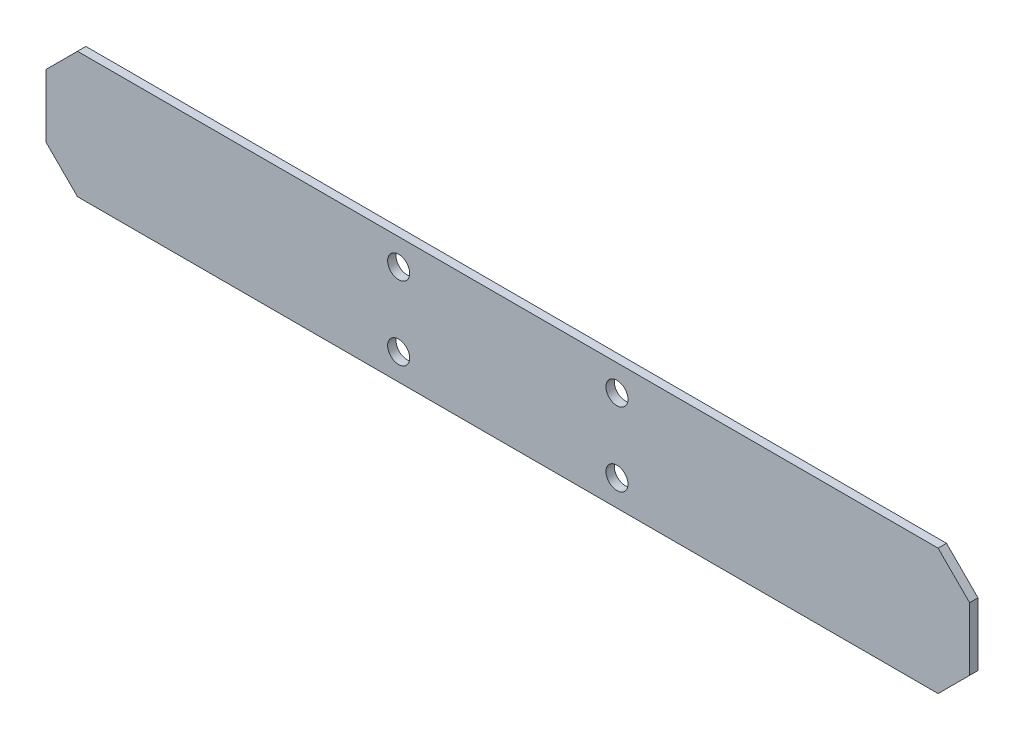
ISO-10303-21;
HEADER;
FILE_DESCRIPTION(('STEP AP214'),'2;1');
FILE_NAME('part.step','',(''),(''),'','','');
FILE_SCHEMA(('AUTOMOTIVE_DESIGN { 1 0 10303 214 1 1 1 1 }'));
ENDSEC;
DATA;
#1=APPLICATION_CONTEXT('core data for automotive mechanical design processes');
#2=APPLICATION_PROTOCOL_DEFINITION('international standard','automotive_design',2000,#1);
#3=PRODUCT_CONTEXT('',#1,'mechanical');
#4=PRODUCT('Part','Part','',(#3));
#5=PRODUCT_RELATED_PRODUCT_CATEGORY('part','',(#4));
#6=PRODUCT_DEFINITION_FORMATION('','',#4);
#7=PRODUCT_DEFINITION_CONTEXT('part definition',#1,'design');
#8=PRODUCT_DEFINITION('design','',#6,#7);
#9=PRODUCT_DEFINITION_SHAPE('','',#8);
#10=(LENGTH_UNIT() NAMED_UNIT(*) SI_UNIT(.MILLI.,.METRE.));
#11=(NAMED_UNIT(*) PLANE_ANGLE_UNIT() SI_UNIT($,.RADIAN.));
#12=(NAMED_UNIT(*) SI_UNIT($,.STERADIAN.) SOLID_ANGLE_UNIT());
#13=UNCERTAINTY_MEASURE_WITH_UNIT(LENGTH_MEASURE(1.E-05),#10,'distance_accuracy_value','');
#14=(GEOMETRIC_REPRESENTATION_CONTEXT(3) GLOBAL_UNCERTAINTY_ASSIGNED_CONTEXT((#13)) GLOBAL_UNIT_ASSIGNED_CONTEXT((#10,
#11,#12)) REPRESENTATION_CONTEXT('',''));
#15=CARTESIAN_POINT('',(0.,0.,0.));
#16=DIRECTION('',(0.,0.,1.));
#17=DIRECTION('',(1.,0.,0.));
#18=AXIS2_PLACEMENT_3D('',#15,#16,#17);
#19=CARTESIAN_POINT('',(-440.,-60.,8.));
#20=DIRECTION('',(0.,0.,1.));
#21=DIRECTION('',(1.,0.,0.));
#22=AXIS2_PLACEMENT_3D('',#19,#20,#21);
#23=PLANE('',#22);
#24=CARTESIAN_POINT('',(104.,-35.,8.));
#25=DIRECTION('',(0.,0.,1.));
#26=DIRECTION('',(1.,0.,0.));
#27=AXIS2_PLACEMENT_3D('',#24,#25,#26);
#28=CIRCLE('',#27,10.5);
#29=CARTESIAN_POINT('',(114.5,-35.,8.));
#30=VERTEX_POINT('',#29);
#31=EDGE_CURVE('E190',#30,#30,#28,.T.);
#32=ORIENTED_EDGE('',*,*,#31,.F.);
#33=EDGE_LOOP('',(#32));
#34=FACE_BOUND('',#33,.T.);
#35=CARTESIAN_POINT('',(-104.,35.,8.));
#36=DIRECTION('',(0.,0.,1.));
#37=DIRECTION('',(1.,0.,0.));
#38=AXIS2_PLACEMENT_3D('',#35,#36,#37);
#39=CIRCLE('',#38,10.5);
#40=CARTESIAN_POINT('',(-93.5,35.,8.));
#41=VERTEX_POINT('',#40);
#42=EDGE_CURVE('E177',#41,#41,#39,.T.);
#43=ORIENTED_EDGE('',*,*,#42,.F.);
#44=EDGE_LOOP('',(#43));
#45=FACE_BOUND('',#44,.T.);
#46=DIRECTION('',(1.,0.,0.));
#47=VECTOR('',#46,1.);
#48=CARTESIAN_POINT('',(-440.,-60.,8.));
#49=LINE('',#48,#47);
#50=CARTESIAN_POINT('',(-410.,-60.,8.));
#51=VERTEX_POINT('',#50);
#52=CARTESIAN_POINT('',(410.,-59.9999999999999,8.));
#53=VERTEX_POINT('',#52);
#54=EDGE_CURVE('E144',#51,#53,#49,.T.);
#55=ORIENTED_EDGE('',*,*,#54,.T.);
#56=DIRECTION('',(-0.707106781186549,-0.707106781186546,0.));
#57=VECTOR('',#56,1.);
#58=CARTESIAN_POINT('',(-15.0000000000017,-485.,8.));
#59=LINE('',#58,#57);
#60=CARTESIAN_POINT('',(440.,-29.9999999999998,8.));
#61=VERTEX_POINT('',#60);
#62=EDGE_CURVE('E163',#53,#61,#59,.F.);
#63=ORIENTED_EDGE('',*,*,#62,.T.);
#64=DIRECTION('',(0.,1.,0.));
#65=VECTOR('',#64,1.);
#66=CARTESIAN_POINT('',(440.,60.0000000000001,8.));
#67=LINE('',#66,#65);
#68=CARTESIAN_POINT('',(440.,30.0000000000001,8.));
#69=VERTEX_POINT('',#68);
#70=EDGE_CURVE('E126',#61,#69,#67,.T.);
#71=ORIENTED_EDGE('',*,*,#70,.T.);
#72=DIRECTION('',(0.707106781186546,-0.707106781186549,0.));
#73=VECTOR('',#72,1.);
#74=CARTESIAN_POINT('',(45.0000000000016,425.,8.));
#75=LINE('',#74,#73);
#76=CARTESIAN_POINT('',(410.,60.0000000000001,8.));
#77=VERTEX_POINT('',#76);
#78=EDGE_CURVE('E63',#69,#77,#75,.F.);
#79=ORIENTED_EDGE('',*,*,#78,.T.);
#80=DIRECTION('',(-1.,0.,0.));
#81=VECTOR('',#80,1.);
#82=CARTESIAN_POINT('',(-440.,60.,8.));
#83=LINE('',#82,#81);
#84=CARTESIAN_POINT('',(-410.,60.,8.));
#85=VERTEX_POINT('',#84);
#86=EDGE_CURVE('E148',#77,#85,#83,.T.);
#87=ORIENTED_EDGE('',*,*,#86,.T.);
#88=DIRECTION('',(0.707106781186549,0.707106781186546,0.));
#89=VECTOR('',#88,1.);
#90=CARTESIAN_POINT('',(-485.,-14.9999999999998,8.));
#91=LINE('',#90,#89);
#92=CARTESIAN_POINT('',(-440.,30.0000000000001,8.));
#93=VERTEX_POINT('',#92);
#94=EDGE_CURVE('E158',#85,#93,#91,.F.);
#95=ORIENTED_EDGE('',*,*,#94,.T.);
#96=DIRECTION('',(0.,-1.,0.));
#97=VECTOR('',#96,1.);
#98=CARTESIAN_POINT('',(-440.,60.,8.));
#99=LINE('',#98,#97);
#100=CARTESIAN_POINT('',(-440.,-30.,8.));
#101=VERTEX_POINT('',#100);
#102=EDGE_CURVE('E136',#93,#101,#99,.T.);
#103=ORIENTED_EDGE('',*,*,#102,.T.);
#104=DIRECTION('',(-0.707106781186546,0.707106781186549,0.));
#105=VECTOR('',#104,1.);
#106=CARTESIAN_POINT('',(-425.,-45.,8.));
#107=LINE('',#106,#105);
#108=EDGE_CURVE('E160',#101,#51,#107,.F.);
#109=ORIENTED_EDGE('',*,*,#108,.T.);
#110=EDGE_LOOP('',(#55,#63,#71,#79,#87,#95,#103,#109));
#111=FACE_BOUND('',#110,.T.);
#112=CARTESIAN_POINT('',(-104.,-35.,8.));
#113=DIRECTION('',(0.,0.,1.));
#114=DIRECTION('',(-1.,0.,0.));
#115=AXIS2_PLACEMENT_3D('',#112,#113,#114);
#116=CIRCLE('',#115,10.5);
#117=CARTESIAN_POINT('',(-114.5,-35.,8.));
#118=VERTEX_POINT('',#117);
#119=EDGE_CURVE('E184',#118,#118,#116,.T.);
#120=ORIENTED_EDGE('',*,*,#119,.F.);
#121=EDGE_LOOP('',(#120));
#122=FACE_BOUND('',#121,.T.);
#123=CARTESIAN_POINT('',(104.,35.,8.));
#124=DIRECTION('',(0.,0.,1.));
#125=DIRECTION('',(-1.,0.,0.));
#126=AXIS2_PLACEMENT_3D('',#123,#124,#125);
#127=CIRCLE('',#126,10.5);
#128=CARTESIAN_POINT('',(93.5,35.,8.));
#129=VERTEX_POINT('',#128);
#130=EDGE_CURVE('E196',#129,#129,#127,.T.);
#131=ORIENTED_EDGE('',*,*,#130,.F.);
#132=EDGE_LOOP('',(#131));
#133=FACE_BOUND('',#132,.T.);
#134=ADVANCED_FACE('F41',(#34,#45,#111,#122,#133),#23,.T.);
#135=CARTESIAN_POINT('',(-440.,-60.,0.));
#136=DIRECTION('',(0.,0.,1.));
#137=DIRECTION('',(1.,0.,0.));
#138=AXIS2_PLACEMENT_3D('',#135,#136,#137);
#139=PLANE('',#138);
#140=CARTESIAN_POINT('',(104.,-35.,0.));
#141=DIRECTION('',(0.,0.,1.));
#142=DIRECTION('',(1.,0.,0.));
#143=AXIS2_PLACEMENT_3D('',#140,#141,#142);
#144=CIRCLE('',#143,10.5);
#145=CARTESIAN_POINT('',(114.5,-35.,0.));
#146=VERTEX_POINT('',#145);
#147=EDGE_CURVE('E193',#146,#146,#144,.T.);
#148=ORIENTED_EDGE('',*,*,#147,.T.);
#149=EDGE_LOOP('',(#148));
#150=FACE_BOUND('',#149,.T.);
#151=CARTESIAN_POINT('',(-104.,35.,0.));
#152=DIRECTION('',(0.,0.,1.));
#153=DIRECTION('',(1.,0.,0.));
#154=AXIS2_PLACEMENT_3D('',#151,#152,#153);
#155=CIRCLE('',#154,10.5);
#156=CARTESIAN_POINT('',(-93.5,35.,0.));
#157=VERTEX_POINT('',#156);
#158=EDGE_CURVE('E179',#157,#157,#155,.T.);
#159=ORIENTED_EDGE('',*,*,#158,.T.);
#160=EDGE_LOOP('',(#159));
#161=FACE_BOUND('',#160,.T.);
#162=DIRECTION('',(0.,1.,0.));
#163=VECTOR('',#162,1.);
#164=CARTESIAN_POINT('',(440.,60.0000000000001,0.));
#165=LINE('',#164,#163);
#166=CARTESIAN_POINT('',(440.,-29.9999999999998,0.));
#167=VERTEX_POINT('',#166);
#168=CARTESIAN_POINT('',(440.,30.,0.));
#169=VERTEX_POINT('',#168);
#170=EDGE_CURVE('E124',#167,#169,#165,.T.);
#171=ORIENTED_EDGE('',*,*,#170,.F.);
#172=DIRECTION('',(0.707106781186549,0.707106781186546,0.));
#173=VECTOR('',#172,1.);
#174=CARTESIAN_POINT('',(440.,-29.9999999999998,0.));
#175=LINE('',#174,#173);
#176=CARTESIAN_POINT('',(410.,-59.9999999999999,0.));
#177=VERTEX_POINT('',#176);
#178=EDGE_CURVE('E107',#167,#177,#175,.F.);
#179=ORIENTED_EDGE('',*,*,#178,.T.);
#180=DIRECTION('',(1.,0.,0.));
#181=VECTOR('',#180,1.);
#182=CARTESIAN_POINT('',(-440.,-60.,0.));
#183=LINE('',#182,#181);
#184=CARTESIAN_POINT('',(-410.,-60.,0.));
#185=VERTEX_POINT('',#184);
#186=EDGE_CURVE('E134',#185,#177,#183,.T.);
#187=ORIENTED_EDGE('',*,*,#186,.F.);
#188=DIRECTION('',(0.707106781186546,-0.707106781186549,0.));
#189=VECTOR('',#188,1.);
#190=CARTESIAN_POINT('',(-410.,-60.,0.));
#191=LINE('',#190,#189);
#192=CARTESIAN_POINT('',(-440.,-30.,0.));
#193=VERTEX_POINT('',#192);
#194=EDGE_CURVE('E152',#185,#193,#191,.F.);
#195=ORIENTED_EDGE('',*,*,#194,.T.);
#196=DIRECTION('',(0.,-1.,0.));
#197=VECTOR('',#196,1.);
#198=CARTESIAN_POINT('',(-440.,60.,0.));
#199=LINE('',#198,#197);
#200=CARTESIAN_POINT('',(-440.,30.0000000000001,0.));
#201=VERTEX_POINT('',#200);
#202=EDGE_CURVE('E138',#201,#193,#199,.T.);
#203=ORIENTED_EDGE('',*,*,#202,.F.);
#204=DIRECTION('',(-0.707106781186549,-0.707106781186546,0.));
#205=VECTOR('',#204,1.);
#206=CARTESIAN_POINT('',(-440.,30.0000000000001,0.));
#207=LINE('',#206,#205);
#208=CARTESIAN_POINT('',(-410.,60.,0.));
#209=VERTEX_POINT('',#208);
#210=EDGE_CURVE('E127',#201,#209,#207,.F.);
#211=ORIENTED_EDGE('',*,*,#210,.T.);
#212=DIRECTION('',(-1.,0.,0.));
#213=VECTOR('',#212,1.);
#214=CARTESIAN_POINT('',(-440.,60.,0.));
#215=LINE('',#214,#213);
#216=CARTESIAN_POINT('',(410.,60.0000000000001,0.));
#217=VERTEX_POINT('',#216);
#218=EDGE_CURVE('E133',#217,#209,#215,.T.);
#219=ORIENTED_EDGE('',*,*,#218,.F.);
#220=DIRECTION('',(-0.707106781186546,0.707106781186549,0.));
#221=VECTOR('',#220,1.);
#222=CARTESIAN_POINT('',(410.,60.0000000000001,0.));
#223=LINE('',#222,#221);
#224=EDGE_CURVE('E118',#217,#169,#223,.F.);
#225=ORIENTED_EDGE('',*,*,#224,.T.);
#226=EDGE_LOOP('',(#171,#179,#187,#195,#203,#211,#219,#225));
#227=FACE_BOUND('',#226,.T.);
#228=CARTESIAN_POINT('',(-104.,-35.,0.));
#229=DIRECTION('',(0.,0.,1.));
#230=DIRECTION('',(-1.,0.,0.));
#231=AXIS2_PLACEMENT_3D('',#228,#229,#230);
#232=CIRCLE('',#231,10.5);
#233=CARTESIAN_POINT('',(-114.5,-35.,0.));
#234=VERTEX_POINT('',#233);
#235=EDGE_CURVE('E187',#234,#234,#232,.T.);
#236=ORIENTED_EDGE('',*,*,#235,.T.);
#237=EDGE_LOOP('',(#236));
#238=FACE_BOUND('',#237,.T.);
#239=CARTESIAN_POINT('',(104.,35.,0.));
#240=DIRECTION('',(0.,0.,1.));
#241=DIRECTION('',(-1.,0.,0.));
#242=AXIS2_PLACEMENT_3D('',#239,#240,#241);
#243=CIRCLE('',#242,10.5);
#244=CARTESIAN_POINT('',(93.5,35.,0.));
#245=VERTEX_POINT('',#244);
#246=EDGE_CURVE('E199',#245,#245,#243,.T.);
#247=ORIENTED_EDGE('',*,*,#246,.T.);
#248=EDGE_LOOP('',(#247));
#249=FACE_BOUND('',#248,.T.);
#250=ADVANCED_FACE('F130',(#150,#161,#227,#238,#249),#139,.F.);
#251=CARTESIAN_POINT('',(-440.,60.,8.));
#252=DIRECTION('',(1.,0.,0.));
#253=DIRECTION('',(0.,0.,-1.));
#254=AXIS2_PLACEMENT_3D('',#251,#252,#253);
#255=PLANE('',#254);
#256=ORIENTED_EDGE('',*,*,#202,.T.);
#257=DIRECTION('',(0.,0.,1.));
#258=VECTOR('',#257,1.);
#259=CARTESIAN_POINT('',(-440.,-30.,8.));
#260=LINE('',#259,#258);
#261=EDGE_CURVE('E11',#193,#101,#260,.T.);
#262=ORIENTED_EDGE('',*,*,#261,.T.);
#263=ORIENTED_EDGE('',*,*,#102,.F.);
#264=DIRECTION('',(0.,0.,-1.));
#265=VECTOR('',#264,1.);
#266=CARTESIAN_POINT('',(-440.,30.0000000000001,8.));
#267=LINE('',#266,#265);
#268=EDGE_CURVE('E49',#93,#201,#267,.T.);
#269=ORIENTED_EDGE('',*,*,#268,.T.);
#270=EDGE_LOOP('',(#256,#262,#263,#269));
#271=FACE_BOUND('',#270,.T.);
#272=ADVANCED_FACE('F43',(#271),#255,.F.);
#273=CARTESIAN_POINT('',(-440.,-60.,8.));
#274=DIRECTION('',(0.,1.,0.));
#275=DIRECTION('',(-1.,0.,0.));
#276=AXIS2_PLACEMENT_3D('',#273,#274,#275);
#277=PLANE('',#276);
#278=ORIENTED_EDGE('',*,*,#186,.T.);
#279=DIRECTION('',(0.,0.,1.));
#280=VECTOR('',#279,1.);
#281=CARTESIAN_POINT('',(410.,-59.9999999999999,8.));
#282=LINE('',#281,#280);
#283=EDGE_CURVE('E112',#177,#53,#282,.T.);
#284=ORIENTED_EDGE('',*,*,#283,.T.);
#285=ORIENTED_EDGE('',*,*,#54,.F.);
#286=DIRECTION('',(0.,0.,-1.));
#287=VECTOR('',#286,1.);
#288=CARTESIAN_POINT('',(-410.,-60.,8.));
#289=LINE('',#288,#287);
#290=EDGE_CURVE('E117',#51,#185,#289,.T.);
#291=ORIENTED_EDGE('',*,*,#290,.T.);
#292=EDGE_LOOP('',(#278,#284,#285,#291));
#293=FACE_BOUND('',#292,.T.);
#294=ADVANCED_FACE('F235',(#293),#277,.F.);
#295=CARTESIAN_POINT('',(440.,60.0000000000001,8.));
#296=DIRECTION('',(-1.,0.,0.));
#297=DIRECTION('',(0.,0.,1.));
#298=AXIS2_PLACEMENT_3D('',#295,#296,#297);
#299=PLANE('',#298);
#300=ORIENTED_EDGE('',*,*,#70,.F.);
#301=DIRECTION('',(0.,0.,-1.));
#302=VECTOR('',#301,1.);
#303=CARTESIAN_POINT('',(440.,-29.9999999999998,8.));
#304=LINE('',#303,#302);
#305=EDGE_CURVE('E111',#61,#167,#304,.T.);
#306=ORIENTED_EDGE('',*,*,#305,.T.);
#307=ORIENTED_EDGE('',*,*,#170,.T.);
#308=DIRECTION('',(0.,0.,1.));
#309=VECTOR('',#308,1.);
#310=CARTESIAN_POINT('',(440.,30.,8.));
#311=LINE('',#310,#309);
#312=EDGE_CURVE('E128',#169,#69,#311,.T.);
#313=ORIENTED_EDGE('',*,*,#312,.T.);
#314=EDGE_LOOP('',(#300,#306,#307,#313));
#315=FACE_BOUND('',#314,.T.);
#316=ADVANCED_FACE('F123',(#315),#299,.F.);
#317=CARTESIAN_POINT('',(-440.,60.,8.));
#318=DIRECTION('',(0.,-1.,0.));
#319=DIRECTION('',(1.,0.,0.));
#320=AXIS2_PLACEMENT_3D('',#317,#318,#319);
#321=PLANE('',#320);
#322=ORIENTED_EDGE('',*,*,#86,.F.);
#323=DIRECTION('',(0.,0.,-1.));
#324=VECTOR('',#323,1.);
#325=CARTESIAN_POINT('',(410.,60.0000000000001,8.));
#326=LINE('',#325,#324);
#327=EDGE_CURVE('E166',#77,#217,#326,.T.);
#328=ORIENTED_EDGE('',*,*,#327,.T.);
#329=ORIENTED_EDGE('',*,*,#218,.T.);
#330=DIRECTION('',(0.,0.,1.));
#331=VECTOR('',#330,1.);
#332=CARTESIAN_POINT('',(-410.,60.,8.));
#333=LINE('',#332,#331);
#334=EDGE_CURVE('E56',#209,#85,#333,.T.);
#335=ORIENTED_EDGE('',*,*,#334,.T.);
#336=EDGE_LOOP('',(#322,#328,#329,#335));
#337=FACE_BOUND('',#336,.T.);
#338=ADVANCED_FACE('F230',(#337),#321,.F.);
#339=CARTESIAN_POINT('',(-104.,35.,8.));
#340=DIRECTION('',(0.,0.,-1.));
#341=DIRECTION('',(-1.,0.,0.));
#342=AXIS2_PLACEMENT_3D('',#339,#340,#341);
#343=CYLINDRICAL_SURFACE('',#342,10.5);
#344=ORIENTED_EDGE('',*,*,#42,.T.);
#345=EDGE_LOOP('',(#344));
#346=FACE_BOUND('',#345,.T.);
#347=ORIENTED_EDGE('',*,*,#158,.F.);
#348=EDGE_LOOP('',(#347));
#349=FACE_BOUND('',#348,.T.);
#350=ADVANCED_FACE('F233',(#346,#349),#343,.F.);
#351=CARTESIAN_POINT('',(-104.,-35.,8.));
#352=DIRECTION('',(0.,0.,-1.));
#353=DIRECTION('',(-1.,0.,0.));
#354=AXIS2_PLACEMENT_3D('',#351,#352,#353);
#355=CYLINDRICAL_SURFACE('',#354,10.5);
#356=ORIENTED_EDGE('',*,*,#119,.T.);
#357=EDGE_LOOP('',(#356));
#358=FACE_BOUND('',#357,.T.);
#359=ORIENTED_EDGE('',*,*,#235,.F.);
#360=EDGE_LOOP('',(#359));
#361=FACE_BOUND('',#360,.T.);
#362=ADVANCED_FACE('F216',(#358,#361),#355,.F.);
#363=CARTESIAN_POINT('',(104.,-35.,8.));
#364=DIRECTION('',(0.,0.,-1.));
#365=DIRECTION('',(-1.,0.,0.));
#366=AXIS2_PLACEMENT_3D('',#363,#364,#365);
#367=CYLINDRICAL_SURFACE('',#366,10.5);
#368=ORIENTED_EDGE('',*,*,#31,.T.);
#369=EDGE_LOOP('',(#368));
#370=FACE_BOUND('',#369,.T.);
#371=ORIENTED_EDGE('',*,*,#147,.F.);
#372=EDGE_LOOP('',(#371));
#373=FACE_BOUND('',#372,.T.);
#374=ADVANCED_FACE('F206',(#370,#373),#367,.F.);
#375=CARTESIAN_POINT('',(104.,35.,8.));
#376=DIRECTION('',(0.,0.,-1.));
#377=DIRECTION('',(-1.,0.,0.));
#378=AXIS2_PLACEMENT_3D('',#375,#376,#377);
#379=CYLINDRICAL_SURFACE('',#378,10.5);
#380=ORIENTED_EDGE('',*,*,#130,.T.);
#381=EDGE_LOOP('',(#380));
#382=FACE_BOUND('',#381,.T.);
#383=ORIENTED_EDGE('',*,*,#246,.F.);
#384=EDGE_LOOP('',(#383));
#385=FACE_BOUND('',#384,.T.);
#386=ADVANCED_FACE('F204',(#382,#385),#379,.F.);
#387=CARTESIAN_POINT('',(440.,-29.9999999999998,8.));
#388=DIRECTION('',(-0.707106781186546,0.707106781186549,0.));
#389=DIRECTION('',(-0.707106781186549,-0.707106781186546,0.));
#390=AXIS2_PLACEMENT_3D('',#387,#388,#389);
#391=PLANE('',#390);
#392=ORIENTED_EDGE('',*,*,#62,.F.);
#393=ORIENTED_EDGE('',*,*,#283,.F.);
#394=ORIENTED_EDGE('',*,*,#178,.F.);
#395=ORIENTED_EDGE('',*,*,#305,.F.);
#396=EDGE_LOOP('',(#392,#393,#394,#395));
#397=FACE_BOUND('',#396,.T.);
#398=ADVANCED_FACE('F110',(#397),#391,.F.);
#399=CARTESIAN_POINT('',(410.,60.0000000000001,8.));
#400=DIRECTION('',(-0.707106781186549,-0.707106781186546,0.));
#401=DIRECTION('',(0.707106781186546,-0.707106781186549,0.));
#402=AXIS2_PLACEMENT_3D('',#399,#400,#401);
#403=PLANE('',#402);
#404=ORIENTED_EDGE('',*,*,#78,.F.);
#405=ORIENTED_EDGE('',*,*,#312,.F.);
#406=ORIENTED_EDGE('',*,*,#224,.F.);
#407=ORIENTED_EDGE('',*,*,#327,.F.);
#408=EDGE_LOOP('',(#404,#405,#406,#407));
#409=FACE_BOUND('',#408,.T.);
#410=ADVANCED_FACE('F214',(#409),#403,.F.);
#411=CARTESIAN_POINT('',(-410.,-60.,8.));
#412=DIRECTION('',(0.707106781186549,0.707106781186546,0.));
#413=DIRECTION('',(-0.707106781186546,0.707106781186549,0.));
#414=AXIS2_PLACEMENT_3D('',#411,#412,#413);
#415=PLANE('',#414);
#416=ORIENTED_EDGE('',*,*,#108,.F.);
#417=ORIENTED_EDGE('',*,*,#261,.F.);
#418=ORIENTED_EDGE('',*,*,#194,.F.);
#419=ORIENTED_EDGE('',*,*,#290,.F.);
#420=EDGE_LOOP('',(#416,#417,#418,#419));
#421=FACE_BOUND('',#420,.T.);
#422=ADVANCED_FACE('F245',(#421),#415,.F.);
#423=CARTESIAN_POINT('',(-440.,30.0000000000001,8.));
#424=DIRECTION('',(0.707106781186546,-0.707106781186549,0.));
#425=DIRECTION('',(0.707106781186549,0.707106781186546,0.));
#426=AXIS2_PLACEMENT_3D('',#423,#424,#425);
#427=PLANE('',#426);
#428=ORIENTED_EDGE('',*,*,#94,.F.);
#429=ORIENTED_EDGE('',*,*,#334,.F.);
#430=ORIENTED_EDGE('',*,*,#210,.F.);
#431=ORIENTED_EDGE('',*,*,#268,.F.);
#432=EDGE_LOOP('',(#428,#429,#430,#431));
#433=FACE_BOUND('',#432,.T.);
#434=ADVANCED_FACE('F247',(#433),#427,.F.);
#435=CLOSED_SHELL('',(#134,#250,#272,#294,#316,#338,#350,#362,#374,#386,#398,#410,#422,#434));
#436=MANIFOLD_SOLID_BREP('B2',#435);
#437=ADVANCED_BREP_SHAPE_REPRESENTATION('',(#18,#436),#14);
#438=SHAPE_DEFINITION_REPRESENTATION(#9,#437);
ENDSEC;
END-ISO-10303-21;
